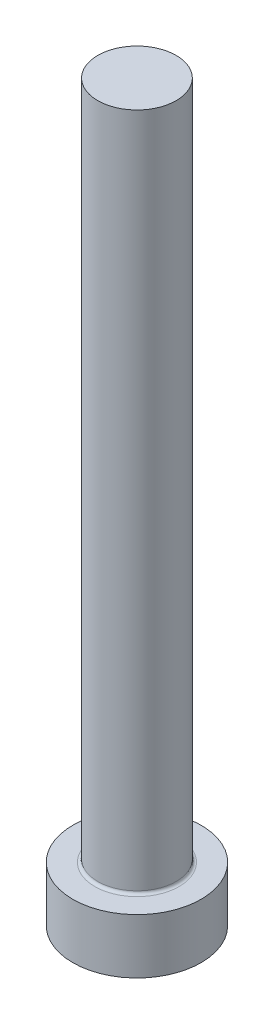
ISO-10303-21;
HEADER;
FILE_DESCRIPTION(('STEP AP214'),'2;1');
FILE_NAME('part.step','',(''),(''),'','','');
FILE_SCHEMA(('AUTOMOTIVE_DESIGN { 1 0 10303 214 1 1 1 1 }'));
ENDSEC;
DATA;
#1=APPLICATION_CONTEXT('core data for automotive mechanical design processes');
#2=APPLICATION_PROTOCOL_DEFINITION('international standard','automotive_design',2000,#1);
#3=PRODUCT_CONTEXT('',#1,'mechanical');
#4=PRODUCT('Part','Part','',(#3));
#5=PRODUCT_RELATED_PRODUCT_CATEGORY('part','',(#4));
#6=PRODUCT_DEFINITION_FORMATION('','',#4);
#7=PRODUCT_DEFINITION_CONTEXT('part definition',#1,'design');
#8=PRODUCT_DEFINITION('design','',#6,#7);
#9=PRODUCT_DEFINITION_SHAPE('','',#8);
#10=(LENGTH_UNIT() NAMED_UNIT(*) SI_UNIT(.MILLI.,.METRE.));
#11=(NAMED_UNIT(*) PLANE_ANGLE_UNIT() SI_UNIT($,.RADIAN.));
#12=(NAMED_UNIT(*) SI_UNIT($,.STERADIAN.) SOLID_ANGLE_UNIT());
#13=UNCERTAINTY_MEASURE_WITH_UNIT(LENGTH_MEASURE(1.E-05),#10,'distance_accuracy_value','');
#14=(GEOMETRIC_REPRESENTATION_CONTEXT(3) GLOBAL_UNCERTAINTY_ASSIGNED_CONTEXT((#13)) GLOBAL_UNIT_ASSIGNED_CONTEXT((#10,
#11,#12)) REPRESENTATION_CONTEXT('',''));
#15=CARTESIAN_POINT('',(0.,0.,0.));
#16=DIRECTION('',(0.,0.,1.));
#17=DIRECTION('',(1.,0.,0.));
#18=AXIS2_PLACEMENT_3D('',#15,#16,#17);
#19=CARTESIAN_POINT('',(0.,63.5,0.));
#20=DIRECTION('',(0.,-1.,0.));
#21=DIRECTION('',(0.,0.,-1.));
#22=AXIS2_PLACEMENT_3D('',#19,#20,#21);
#23=PLANE('',#22);
#24=CARTESIAN_POINT('',(0.,63.5,0.));
#25=DIRECTION('',(0.,1.,0.));
#26=DIRECTION('',(0.,0.,1.));
#27=AXIS2_PLACEMENT_3D('',#24,#25,#26);
#28=CIRCLE('',#27,3.3909);
#29=CARTESIAN_POINT('',(0.,63.5,3.3909));
#30=VERTEX_POINT('',#29);
#31=EDGE_CURVE('E10',#30,#30,#28,.T.);
#32=ORIENTED_EDGE('',*,*,#31,.T.);
#33=EDGE_LOOP('',(#32));
#34=FACE_BOUND('',#33,.T.);
#35=ADVANCED_FACE('F30',(#34),#23,.F.);
#36=CARTESIAN_POINT('',(0.,0.,0.));
#37=DIRECTION('',(0.,1.,0.));
#38=DIRECTION('',(0.,0.,1.));
#39=AXIS2_PLACEMENT_3D('',#36,#37,#38);
#40=CYLINDRICAL_SURFACE('',#39,3.3909);
#41=ORIENTED_EDGE('',*,*,#31,.F.);
#42=EDGE_LOOP('',(#41));
#43=FACE_BOUND('',#42,.T.);
#44=CARTESIAN_POINT('',(0.,5.0038,0.));
#45=DIRECTION('',(0.,1.,0.));
#46=DIRECTION('',(0.,0.,1.));
#47=AXIS2_PLACEMENT_3D('',#44,#45,#46);
#48=CIRCLE('',#47,3.3909);
#49=CARTESIAN_POINT('',(0.,5.0038,3.3909));
#50=VERTEX_POINT('',#49);
#51=EDGE_CURVE('E36',#50,#50,#48,.T.);
#52=ORIENTED_EDGE('',*,*,#51,.T.);
#53=EDGE_LOOP('',(#52));
#54=FACE_BOUND('',#53,.T.);
#55=ADVANCED_FACE('F65',(#43,#54),#40,.T.);
#56=CARTESIAN_POINT('',(0.,5.0038,0.));
#57=DIRECTION('',(0.,1.,0.));
#58=DIRECTION('',(0.,0.,1.));
#59=AXIS2_PLACEMENT_3D('',#56,#57,#58);
#60=TOROIDAL_SURFACE('',#59,3.6449,0.254);
#61=ORIENTED_EDGE('',*,*,#51,.F.);
#62=EDGE_LOOP('',(#61));
#63=FACE_BOUND('',#62,.T.);
#64=CARTESIAN_POINT('',(0.,4.7498,0.));
#65=DIRECTION('',(0.,1.,0.));
#66=DIRECTION('',(0.,0.,1.));
#67=AXIS2_PLACEMENT_3D('',#64,#65,#66);
#68=CIRCLE('',#67,3.6449);
#69=CARTESIAN_POINT('',(0.,4.7498,3.6449));
#70=VERTEX_POINT('',#69);
#71=EDGE_CURVE('E40',#70,#70,#68,.T.);
#72=ORIENTED_EDGE('',*,*,#71,.T.);
#73=EDGE_LOOP('',(#72));
#74=FACE_BOUND('',#73,.T.);
#75=ADVANCED_FACE('F69',(#63,#74),#60,.F.);
#76=CARTESIAN_POINT('',(5.5499,4.7498,0.));
#77=DIRECTION('',(0.,-1.,0.));
#78=DIRECTION('',(0.,0.,-1.));
#79=AXIS2_PLACEMENT_3D('',#76,#77,#78);
#80=PLANE('',#79);
#81=ORIENTED_EDGE('',*,*,#71,.F.);
#82=EDGE_LOOP('',(#81));
#83=FACE_BOUND('',#82,.T.);
#84=CARTESIAN_POINT('',(0.,4.7498,0.));
#85=DIRECTION('',(0.,1.,0.));
#86=DIRECTION('',(0.,0.,1.));
#87=AXIS2_PLACEMENT_3D('',#84,#85,#86);
#88=CIRCLE('',#87,5.5499);
#89=CARTESIAN_POINT('',(0.,4.7498,5.5499));
#90=VERTEX_POINT('',#89);
#91=EDGE_CURVE('E44',#90,#90,#88,.T.);
#92=ORIENTED_EDGE('',*,*,#91,.T.);
#93=EDGE_LOOP('',(#92));
#94=FACE_BOUND('',#93,.T.);
#95=ADVANCED_FACE('F61',(#83,#94),#80,.F.);
#96=CARTESIAN_POINT('',(0.,0.,0.));
#97=DIRECTION('',(0.,1.,0.));
#98=DIRECTION('',(0.,0.,1.));
#99=AXIS2_PLACEMENT_3D('',#96,#97,#98);
#100=CYLINDRICAL_SURFACE('',#99,5.5499);
#101=ORIENTED_EDGE('',*,*,#91,.F.);
#102=EDGE_LOOP('',(#101));
#103=FACE_BOUND('',#102,.T.);
#104=CARTESIAN_POINT('',(0.,0.,0.));
#105=DIRECTION('',(0.,1.,0.));
#106=DIRECTION('',(0.,0.,1.));
#107=AXIS2_PLACEMENT_3D('',#104,#105,#106);
#108=CIRCLE('',#107,5.5499);
#109=CARTESIAN_POINT('',(0.,0.,5.5499));
#110=VERTEX_POINT('',#109);
#111=EDGE_CURVE('E49',#110,#110,#108,.T.);
#112=ORIENTED_EDGE('',*,*,#111,.T.);
#113=EDGE_LOOP('',(#112));
#114=FACE_BOUND('',#113,.T.);
#115=ADVANCED_FACE('F53',(#103,#114),#100,.T.);
#116=CARTESIAN_POINT('',(0.,0.,0.));
#117=DIRECTION('',(0.,1.,0.));
#118=DIRECTION('',(0.,0.,1.));
#119=AXIS2_PLACEMENT_3D('',#116,#117,#118);
#120=PLANE('',#119);
#121=ORIENTED_EDGE('',*,*,#111,.F.);
#122=EDGE_LOOP('',(#121));
#123=FACE_BOUND('',#122,.T.);
#124=ADVANCED_FACE('F55',(#123),#120,.F.);
#125=CLOSED_SHELL('',(#35,#55,#75,#95,#115,#124));
#126=MANIFOLD_SOLID_BREP('B2',#125);
#127=ADVANCED_BREP_SHAPE_REPRESENTATION('',(#18,#126),#14);
#128=SHAPE_DEFINITION_REPRESENTATION(#9,#127);
ENDSEC;
END-ISO-10303-21;
